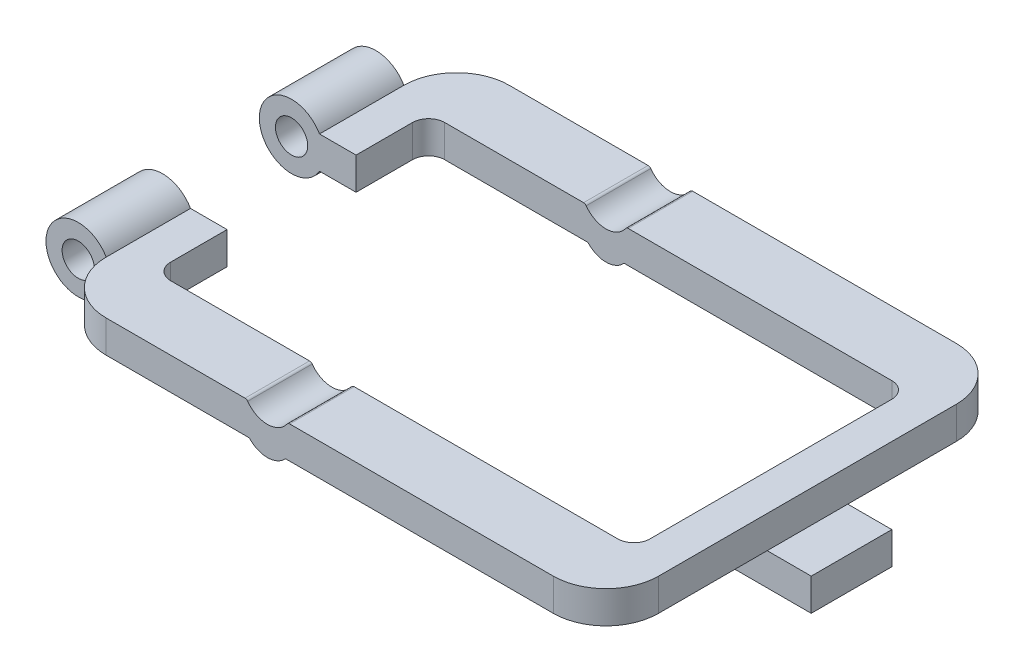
from build123d import *

# Parameters (mm, degrees)
EXTRUSION1_DEPTH             = 125
EXTRUSION2_DEPTH             = 250
ENL_V_MAT_EXTRU_1_DEPTH      = 383.262998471
ESQUISSE3_R                  = 10
ENL_V_MAT_EXTRU_2_DEPTH      = 439.74821937
ENL_V_MAT_EXTRU_3_DEPTH      = 382.608438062
ENL_V_MAT_EXTRU_3_DEPTH_BACK = 382.608438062
ESQUISSE4_W                  = 60
ESQUISSE4_H                  = 80
ENL_V_MAT_EXTRU_7_DEPTH      = 383.262998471
ENL_V_MAT_EXTRU_7_DEPTH_BACK = 383.262998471
ESQUISSE11_W                 = 50
ESQUISSE11_H                 = 50
EXTRUSION3_DEPTH             = 20
ENL_V_MAT_EXTRU_8_DEPTH      = 462.970542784
CONG_1_R                     = 2
CONG_2_R                     = 2


with BuildPart() as part:
    # Esquisse1 → Extrusion1 (new, symmetric)
    with BuildSketch(Plane.XY):
        with BuildLine():
            Line((360, -10), (17.320508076, -10))
            ThreePointArc((17.320508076, -10), (-20, 0), (17.320508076, 10))
            Line((17.320508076, 10), (360, 10))
            Line((360, 10), (360, -10))
        make_face()
    extrude(amount=EXTRUSION1_DEPTH, both=True)

    # Esquisse6 → Extrusion2 (add)
    with BuildSketch(Plane.XY.offset(125)):
        with BuildLine():
            Line((138.819660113, -10), (161.180339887, -10))
            ThreePointArc((161.180339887, -10), (150, -15), (138.819660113, -10))
        make_face()
    extrude(amount=-EXTRUSION2_DEPTH)

    # Esquisse2 → Enl_v. mat.-Extru.1 (cut, through all)
    with BuildSketch(Plane(origin=(0, 10, 0), x_dir=(1, 0, 0), z_dir=(0, 1, 0))):
        with BuildLine():
            Line((50, 85), (327.32, 85))
            ThreePointArc((327.32, 85), (334.391067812, 82.071067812), (337.32, 75))
            Line((337.32, 75), (337.32, -75))
            ThreePointArc((337.32, -75), (334.391067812, -82.071067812), (327.32, -85))
            Line((327.32, -85), (50, -85))
            ThreePointArc((50, -85), (42.928932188, -82.071067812), (40, -75))
            Line((40, -75), (40, 75))
            ThreePointArc((40, 75), (42.928932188, 82.071067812), (50, 85))
        make_face()
    extrude(amount=-ENL_V_MAT_EXTRU_1_DEPTH, mode=Mode.SUBTRACT)

    # Esquisse3 → Enl_v. mat.-Extru.2 (cut, through all)
    with BuildSketch(Plane.XY.offset(125)):
        Circle(ESQUISSE3_R)
    extrude(amount=-ENL_V_MAT_EXTRU_2_DEPTH, mode=Mode.SUBTRACT)

    # Esquisse4 → Enl_v. mat.-Extru.3 (cut, two sides: drawn at the far end of the back side and taken through both)
    with BuildSketch(Plane(origin=(0, 0, 0), x_dir=(1, 0, 0), z_dir=(0, 1, 0)).offset(-ENL_V_MAT_EXTRU_3_DEPTH_BACK)):
        with Locations((10, 0)):
            Rectangle(ESQUISSE4_W, ESQUISSE4_H)
    extrude(amount=ENL_V_MAT_EXTRU_3_DEPTH + ENL_V_MAT_EXTRU_3_DEPTH_BACK, mode=Mode.SUBTRACT)

    # Esquisse10 → Enl_v. mat.-Extru.7 (cut, two sides: drawn at the far end of the back side and taken through both)
    with BuildSketch(Plane(origin=(0, 10, 0), x_dir=(1, 0, 0), z_dir=(0, 1, 0)).offset(-ENL_V_MAT_EXTRU_7_DEPTH_BACK)):
        with BuildLine():
            Line((17.320508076, 92.320508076), (-20, 92.320508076))
            Line((-20, 92.320508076), (-20, 125))
            Line((-20, 125), (50, 125))
            ThreePointArc((50, 125), (26.892109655, 115.428398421), (17.320508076, 92.320508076))
        make_face()
        with BuildLine():
            Line((-20, -125), (50, -125))
            ThreePointArc((50, -125), (26.892109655, -115.428398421), (17.320508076, -92.320508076))
            Line((17.320508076, -92.320508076), (-20, -92.320508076))
            Line((-20, -92.320508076), (-20, -125))
        make_face()
        with BuildLine():
            Line((359.999491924, -92.320508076), (397.32, -92.320508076))
            Line((397.32, -92.320508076), (397.32, -125))
            Line((397.32, -125), (327.32, -125))
            ThreePointArc((327.32, -125), (350.427890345, -115.428398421), (359.999491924, -92.320508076))
        make_face()
        with BuildLine():
            Line((397.32, 125), (327.32, 125))
            ThreePointArc((327.32, 125), (350.427890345, 115.428398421), (359.999491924, 92.320508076))
            Line((359.999491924, 92.320508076), (397.32, 92.320508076))
            Line((397.32, 92.320508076), (397.32, 125))
        make_face()
    extrude(amount=ENL_V_MAT_EXTRU_7_DEPTH + ENL_V_MAT_EXTRU_7_DEPTH_BACK, mode=Mode.SUBTRACT)

    # Esquisse11 → Extrusion3 (add)
    with BuildSketch(Plane.XZ.offset(10)):
        with Locations((362.32, 0)):
            Rectangle(ESQUISSE11_W, ESQUISSE11_H)
    extrude(amount=EXTRUSION3_DEPTH)

    # Esquisse12 → Enl_v. mat.-Extru.8 (cut, through all)
    with BuildSketch(Plane.XY.offset(125)):
        with BuildLine():
            Line((137.218127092, 10), (162.781872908, 10))
            ThreePointArc((162.781872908, 10), (150, 2.850078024), (137.218127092, 10))
        make_face()
    extrude(amount=-ENL_V_MAT_EXTRU_8_DEPTH, mode=Mode.SUBTRACT)

    # Cong_1
    cong_1_edges = [part.edges().sort_by_distance(p)[0] for p in [
        (162.781872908, 10, 105),
        (162.781872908, 10, -105),
        (137.218127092, 10, 105),
        (137.218127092, 10, -105),
    ]]
    fillet(cong_1_edges, radius=CONG_1_R)

    # Cong_2
    cong_2_edges = [part.edges().sort_by_distance(p)[0] for p in [
        (161.180339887, -10, -105),
        (138.819660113, -10, -105),
        (161.180339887, -10, 105),
        (138.819660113, -10, 105),
    ]]
    fillet(cong_2_edges, radius=CONG_2_R)


solid = part.part
